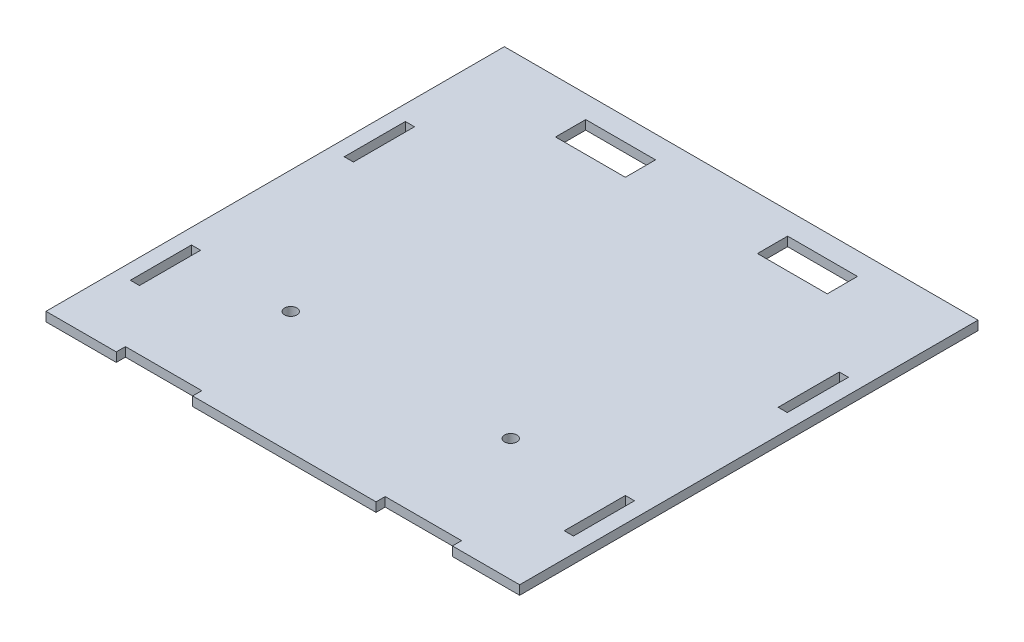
from build123d import *

# Parameters (mm, degrees)
SKETCH2_W           = 155
SKETCH2_H           = 150
BOSS_EXTRUDE1_DEPTH = 3
SKETCH3_R           = 2
SKETCH3_W           = 3
SKETCH3_H           = 20
SKETCH3_W_2         = 25
SKETCH3_H_2         = 3
SKETCH3_W_3         = 24.989887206
SKETCH3_W_4         = 22.847712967
SKETCH3_H_3         = 9.880092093
SKETCH3_W_5         = 22.847712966
CUT_EXTRUDE1_DEPTH  = 10


with BuildPart() as part:
    # Sketch2 → Boss-Extrude1 (new body)
    with BuildSketch(Plane(origin=(0, 0, 0), x_dir=(1, 0, 0), z_dir=(0, 1, 0))):
        Rectangle(SKETCH2_W, SKETCH2_H)
    extrude(amount=BOSS_EXTRUDE1_DEPTH)

    # Sketch3 → Cut-Extrude1 (cut)
    with BuildSketch(Plane.XZ):
        with Locations(Location((-37.41184331, 35, 0), (0, 0, 270))):
            Circle(SKETCH3_R)
        with Locations(Location((34.58815669, 35, 0), (0, 0, 270))):
            Circle(SKETCH3_R)
        with Locations((71, -27.595041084)):
            Rectangle(SKETCH3_W, SKETCH3_H)
        with Locations((71, 42.404958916)):
            Rectangle(SKETCH3_W, SKETCH3_H)
        with Locations((43, 73.5)):
            Rectangle(SKETCH3_W_2, SKETCH3_H_2)
        with Locations((-42.005056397, 73.5)):
            Rectangle(SKETCH3_W_3, SKETCH3_H_2)
        with Locations((-71, 42.404971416)):
            Rectangle(SKETCH3_W, SKETCH3_H)
        with Locations((-71, -27.595028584)):
            Rectangle(SKETCH3_W, SKETCH3_H)
        with Locations((33.962816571, -62.718196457)):
            Rectangle(SKETCH3_W_4, SKETCH3_H_3)
        with Locations((-32.110299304, -62.718196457)):
            Rectangle(SKETCH3_W_5, SKETCH3_H_3)
    extrude(amount=-CUT_EXTRUDE1_DEPTH, mode=Mode.SUBTRACT)


solid = part.part
